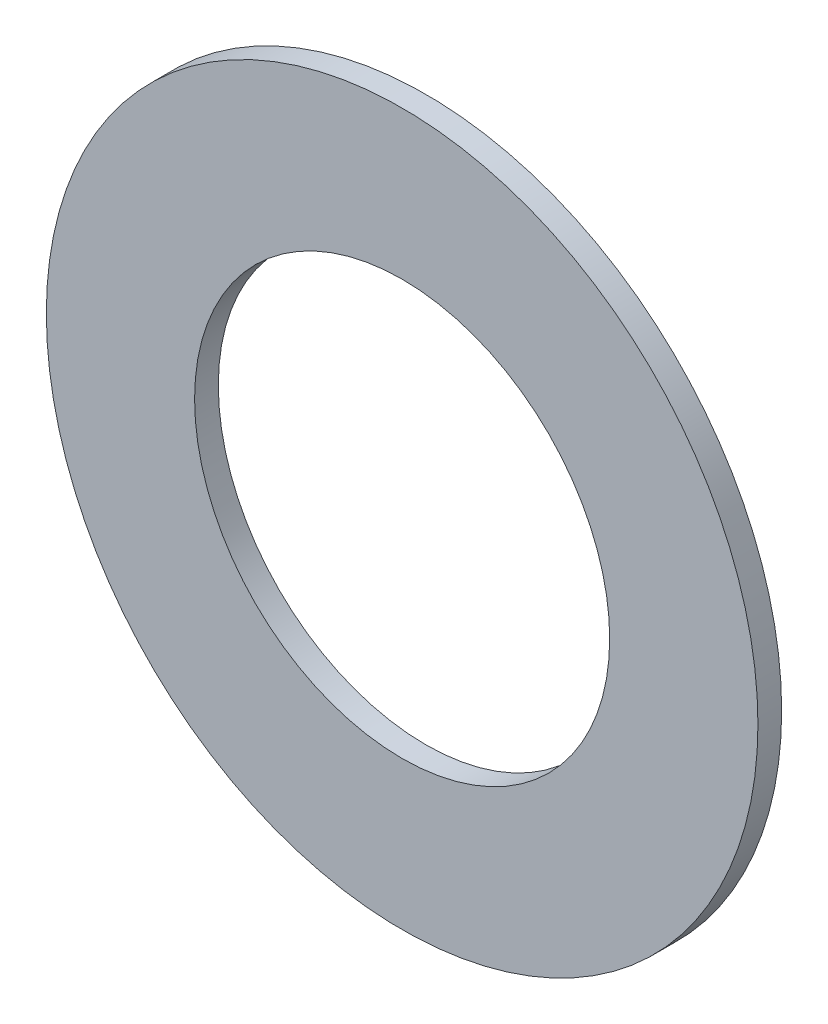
from build123d import *

# Parameters (mm, degrees)
SKETCH1_R           = 6
BOSS_EXTRUDE1_DEPTH = 0.4
SKETCH2_R           = 3.5
CUT_EXTRUDE1_DEPTH  = 0.4


with BuildPart() as part:
    # Sketch1 → Boss-Extrude1 (new body)
    with BuildSketch(Plane.XY):
        Circle(SKETCH1_R)
    extrude(amount=BOSS_EXTRUDE1_DEPTH)

    # Sketch2 → Cut-Extrude1 (cut)
    with BuildSketch(Plane.XY.offset(0.4)):
        Circle(SKETCH2_R)
    extrude(amount=-CUT_EXTRUDE1_DEPTH, mode=Mode.SUBTRACT)


solid = part.part
